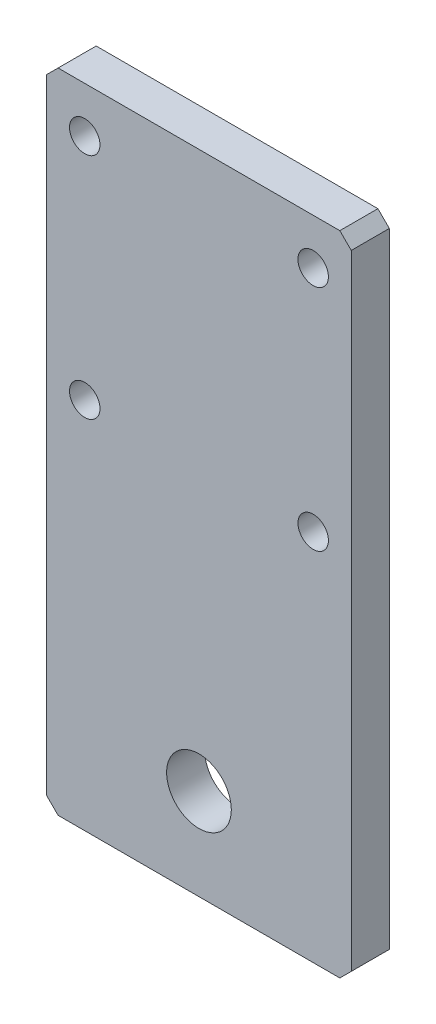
ISO-10303-21;
HEADER;
FILE_DESCRIPTION(('STEP AP214'),'2;1');
FILE_NAME('part.step','',(''),(''),'','','');
FILE_SCHEMA(('AUTOMOTIVE_DESIGN { 1 0 10303 214 1 1 1 1 }'));
ENDSEC;
DATA;
#1=APPLICATION_CONTEXT('core data for automotive mechanical design processes');
#2=APPLICATION_PROTOCOL_DEFINITION('international standard','automotive_design',2000,#1);
#3=PRODUCT_CONTEXT('',#1,'mechanical');
#4=PRODUCT('Part','Part','',(#3));
#5=PRODUCT_RELATED_PRODUCT_CATEGORY('part','',(#4));
#6=PRODUCT_DEFINITION_FORMATION('','',#4);
#7=PRODUCT_DEFINITION_CONTEXT('part definition',#1,'design');
#8=PRODUCT_DEFINITION('design','',#6,#7);
#9=PRODUCT_DEFINITION_SHAPE('','',#8);
#10=(LENGTH_UNIT() NAMED_UNIT(*) SI_UNIT(.MILLI.,.METRE.));
#11=(NAMED_UNIT(*) PLANE_ANGLE_UNIT() SI_UNIT($,.RADIAN.));
#12=(NAMED_UNIT(*) SI_UNIT($,.STERADIAN.) SOLID_ANGLE_UNIT());
#13=UNCERTAINTY_MEASURE_WITH_UNIT(LENGTH_MEASURE(1.E-05),#10,'distance_accuracy_value','');
#14=(GEOMETRIC_REPRESENTATION_CONTEXT(3) GLOBAL_UNCERTAINTY_ASSIGNED_CONTEXT((#13)) GLOBAL_UNIT_ASSIGNED_CONTEXT((#10,
#11,#12)) REPRESENTATION_CONTEXT('',''));
#15=CARTESIAN_POINT('',(0.,0.,0.));
#16=DIRECTION('',(0.,0.,1.));
#17=DIRECTION('',(1.,0.,0.));
#18=AXIS2_PLACEMENT_3D('',#15,#16,#17);
#19=CARTESIAN_POINT('',(80.,3.,10.));
#20=DIRECTION('',(-1.,0.,0.));
#21=DIRECTION('',(0.,0.,1.));
#22=AXIS2_PLACEMENT_3D('',#19,#20,#21);
#23=PLANE('',#22);
#24=DIRECTION('',(0.,1.,0.));
#25=VECTOR('',#24,1.);
#26=CARTESIAN_POINT('',(80.,3.,0.));
#27=LINE('',#26,#25);
#28=CARTESIAN_POINT('',(80.,3.,0.));
#29=VERTEX_POINT('',#28);
#30=CARTESIAN_POINT('',(80.,167.,0.));
#31=VERTEX_POINT('',#30);
#32=EDGE_CURVE('E85',#29,#31,#27,.T.);
#33=ORIENTED_EDGE('',*,*,#32,.T.);
#34=DIRECTION('',(0.,0.,-1.));
#35=VECTOR('',#34,1.);
#36=CARTESIAN_POINT('',(80.,167.,10.));
#37=LINE('',#36,#35);
#38=CARTESIAN_POINT('',(80.,167.,10.));
#39=VERTEX_POINT('',#38);
#40=EDGE_CURVE('E11',#39,#31,#37,.T.);
#41=ORIENTED_EDGE('',*,*,#40,.F.);
#42=DIRECTION('',(0.,1.,0.));
#43=VECTOR('',#42,1.);
#44=CARTESIAN_POINT('',(80.,3.,10.));
#45=LINE('',#44,#43);
#46=CARTESIAN_POINT('',(80.,3.,10.));
#47=VERTEX_POINT('',#46);
#48=EDGE_CURVE('E117',#47,#39,#45,.T.);
#49=ORIENTED_EDGE('',*,*,#48,.F.);
#50=DIRECTION('',(0.,0.,-1.));
#51=VECTOR('',#50,1.);
#52=CARTESIAN_POINT('',(80.,3.,10.));
#53=LINE('',#52,#51);
#54=EDGE_CURVE('E98',#47,#29,#53,.T.);
#55=ORIENTED_EDGE('',*,*,#54,.T.);
#56=EDGE_LOOP('',(#33,#41,#49,#55));
#57=FACE_BOUND('',#56,.T.);
#58=ADVANCED_FACE('F17',(#57),#23,.F.);
#59=CARTESIAN_POINT('',(80.,167.,10.));
#60=DIRECTION('',(-0.707106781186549,-0.707106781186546,0.));
#61=DIRECTION('',(0.707106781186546,-0.707106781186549,0.));
#62=AXIS2_PLACEMENT_3D('',#59,#60,#61);
#63=PLANE('',#62);
#64=DIRECTION('',(-0.707106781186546,0.707106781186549,0.));
#65=VECTOR('',#64,1.);
#66=CARTESIAN_POINT('',(80.,167.,0.));
#67=LINE('',#66,#65);
#68=CARTESIAN_POINT('',(77.,170.,0.));
#69=VERTEX_POINT('',#68);
#70=EDGE_CURVE('E81',#31,#69,#67,.T.);
#71=ORIENTED_EDGE('',*,*,#70,.T.);
#72=DIRECTION('',(0.,0.,-1.));
#73=VECTOR('',#72,1.);
#74=CARTESIAN_POINT('',(77.,170.,10.));
#75=LINE('',#74,#73);
#76=CARTESIAN_POINT('',(77.,170.,10.));
#77=VERTEX_POINT('',#76);
#78=EDGE_CURVE('E24',#77,#69,#75,.T.);
#79=ORIENTED_EDGE('',*,*,#78,.F.);
#80=DIRECTION('',(-0.707106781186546,0.707106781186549,0.));
#81=VECTOR('',#80,1.);
#82=CARTESIAN_POINT('',(80.,167.,10.));
#83=LINE('',#82,#81);
#84=EDGE_CURVE('E94',#39,#77,#83,.T.);
#85=ORIENTED_EDGE('',*,*,#84,.F.);
#86=ORIENTED_EDGE('',*,*,#40,.T.);
#87=EDGE_LOOP('',(#71,#79,#85,#86));
#88=FACE_BOUND('',#87,.T.);
#89=ADVANCED_FACE('F93',(#88),#63,.F.);
#90=CARTESIAN_POINT('',(3.,170.,10.));
#91=DIRECTION('',(0.,-1.,0.));
#92=DIRECTION('',(1.,0.,0.));
#93=AXIS2_PLACEMENT_3D('',#90,#91,#92);
#94=PLANE('',#93);
#95=DIRECTION('',(-1.,0.,0.));
#96=VECTOR('',#95,1.);
#97=CARTESIAN_POINT('',(3.,170.,0.));
#98=LINE('',#97,#96);
#99=CARTESIAN_POINT('',(3.,170.,0.));
#100=VERTEX_POINT('',#99);
#101=EDGE_CURVE('E87',#69,#100,#98,.T.);
#102=ORIENTED_EDGE('',*,*,#101,.T.);
#103=DIRECTION('',(0.,0.,-1.));
#104=VECTOR('',#103,1.);
#105=CARTESIAN_POINT('',(3.,170.,10.));
#106=LINE('',#105,#104);
#107=CARTESIAN_POINT('',(3.,170.,10.));
#108=VERTEX_POINT('',#107);
#109=EDGE_CURVE('E143',#108,#100,#106,.T.);
#110=ORIENTED_EDGE('',*,*,#109,.F.);
#111=DIRECTION('',(-1.,0.,0.));
#112=VECTOR('',#111,1.);
#113=CARTESIAN_POINT('',(3.,170.,10.));
#114=LINE('',#113,#112);
#115=EDGE_CURVE('E120',#77,#108,#114,.T.);
#116=ORIENTED_EDGE('',*,*,#115,.F.);
#117=ORIENTED_EDGE('',*,*,#78,.T.);
#118=EDGE_LOOP('',(#102,#110,#116,#117));
#119=FACE_BOUND('',#118,.T.);
#120=ADVANCED_FACE('F147',(#119),#94,.F.);
#121=CARTESIAN_POINT('',(0.,167.,10.));
#122=DIRECTION('',(0.707106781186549,-0.707106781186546,0.));
#123=DIRECTION('',(0.707106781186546,0.707106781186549,0.));
#124=AXIS2_PLACEMENT_3D('',#121,#122,#123);
#125=PLANE('',#124);
#126=DIRECTION('',(-0.707106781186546,-0.707106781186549,0.));
#127=VECTOR('',#126,1.);
#128=CARTESIAN_POINT('',(0.,167.,0.));
#129=LINE('',#128,#127);
#130=CARTESIAN_POINT('',(0.,167.,0.));
#131=VERTEX_POINT('',#130);
#132=EDGE_CURVE('E107',#100,#131,#129,.T.);
#133=ORIENTED_EDGE('',*,*,#132,.T.);
#134=DIRECTION('',(0.,0.,-1.));
#135=VECTOR('',#134,1.);
#136=CARTESIAN_POINT('',(0.,167.,10.));
#137=LINE('',#136,#135);
#138=CARTESIAN_POINT('',(0.,167.,10.));
#139=VERTEX_POINT('',#138);
#140=EDGE_CURVE('E140',#139,#131,#137,.T.);
#141=ORIENTED_EDGE('',*,*,#140,.F.);
#142=DIRECTION('',(-0.707106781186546,-0.707106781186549,0.));
#143=VECTOR('',#142,1.);
#144=CARTESIAN_POINT('',(0.,167.,10.));
#145=LINE('',#144,#143);
#146=EDGE_CURVE('E122',#108,#139,#145,.T.);
#147=ORIENTED_EDGE('',*,*,#146,.F.);
#148=ORIENTED_EDGE('',*,*,#109,.T.);
#149=EDGE_LOOP('',(#133,#141,#147,#148));
#150=FACE_BOUND('',#149,.T.);
#151=ADVANCED_FACE('F155',(#150),#125,.F.);
#152=CARTESIAN_POINT('',(0.,3.,10.));
#153=DIRECTION('',(1.,0.,0.));
#154=DIRECTION('',(0.,0.,-1.));
#155=AXIS2_PLACEMENT_3D('',#152,#153,#154);
#156=PLANE('',#155);
#157=DIRECTION('',(0.,-1.,0.));
#158=VECTOR('',#157,1.);
#159=CARTESIAN_POINT('',(0.,3.,0.));
#160=LINE('',#159,#158);
#161=CARTESIAN_POINT('',(0.,3.,0.));
#162=VERTEX_POINT('',#161);
#163=EDGE_CURVE('E109',#131,#162,#160,.T.);
#164=ORIENTED_EDGE('',*,*,#163,.T.);
#165=DIRECTION('',(0.,0.,-1.));
#166=VECTOR('',#165,1.);
#167=CARTESIAN_POINT('',(0.,3.,10.));
#168=LINE('',#167,#166);
#169=CARTESIAN_POINT('',(0.,3.,10.));
#170=VERTEX_POINT('',#169);
#171=EDGE_CURVE('E137',#170,#162,#168,.T.);
#172=ORIENTED_EDGE('',*,*,#171,.F.);
#173=DIRECTION('',(0.,-1.,0.));
#174=VECTOR('',#173,1.);
#175=CARTESIAN_POINT('',(0.,3.,10.));
#176=LINE('',#175,#174);
#177=EDGE_CURVE('E124',#139,#170,#176,.T.);
#178=ORIENTED_EDGE('',*,*,#177,.F.);
#179=ORIENTED_EDGE('',*,*,#140,.T.);
#180=EDGE_LOOP('',(#164,#172,#178,#179));
#181=FACE_BOUND('',#180,.T.);
#182=ADVANCED_FACE('F158',(#181),#156,.F.);
#183=CARTESIAN_POINT('',(3.,0.,10.));
#184=DIRECTION('',(0.707106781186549,0.707106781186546,0.));
#185=DIRECTION('',(-0.707106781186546,0.707106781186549,0.));
#186=AXIS2_PLACEMENT_3D('',#183,#184,#185);
#187=PLANE('',#186);
#188=DIRECTION('',(0.707106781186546,-0.707106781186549,0.));
#189=VECTOR('',#188,1.);
#190=CARTESIAN_POINT('',(3.,0.,0.));
#191=LINE('',#190,#189);
#192=CARTESIAN_POINT('',(3.,0.,0.));
#193=VERTEX_POINT('',#192);
#194=EDGE_CURVE('E111',#162,#193,#191,.T.);
#195=ORIENTED_EDGE('',*,*,#194,.T.);
#196=DIRECTION('',(0.,0.,-1.));
#197=VECTOR('',#196,1.);
#198=CARTESIAN_POINT('',(3.,0.,10.));
#199=LINE('',#198,#197);
#200=CARTESIAN_POINT('',(3.,0.,10.));
#201=VERTEX_POINT('',#200);
#202=EDGE_CURVE('E134',#201,#193,#199,.T.);
#203=ORIENTED_EDGE('',*,*,#202,.F.);
#204=DIRECTION('',(0.707106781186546,-0.707106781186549,0.));
#205=VECTOR('',#204,1.);
#206=CARTESIAN_POINT('',(3.,0.,10.));
#207=LINE('',#206,#205);
#208=EDGE_CURVE('E126',#170,#201,#207,.T.);
#209=ORIENTED_EDGE('',*,*,#208,.F.);
#210=ORIENTED_EDGE('',*,*,#171,.T.);
#211=EDGE_LOOP('',(#195,#203,#209,#210));
#212=FACE_BOUND('',#211,.T.);
#213=ADVANCED_FACE('F163',(#212),#187,.F.);
#214=CARTESIAN_POINT('',(3.,0.,10.));
#215=DIRECTION('',(0.,1.,0.));
#216=DIRECTION('',(0.,0.,1.));
#217=AXIS2_PLACEMENT_3D('',#214,#215,#216);
#218=PLANE('',#217);
#219=DIRECTION('',(1.,0.,0.));
#220=VECTOR('',#219,1.);
#221=CARTESIAN_POINT('',(3.,0.,0.));
#222=LINE('',#221,#220);
#223=CARTESIAN_POINT('',(77.,0.,0.));
#224=VERTEX_POINT('',#223);
#225=EDGE_CURVE('E113',#193,#224,#222,.T.);
#226=ORIENTED_EDGE('',*,*,#225,.T.);
#227=DIRECTION('',(0.,0.,-1.));
#228=VECTOR('',#227,1.);
#229=CARTESIAN_POINT('',(77.,0.,10.));
#230=LINE('',#229,#228);
#231=CARTESIAN_POINT('',(77.,0.,10.));
#232=VERTEX_POINT('',#231);
#233=EDGE_CURVE('E131',#232,#224,#230,.T.);
#234=ORIENTED_EDGE('',*,*,#233,.F.);
#235=DIRECTION('',(1.,0.,0.));
#236=VECTOR('',#235,1.);
#237=CARTESIAN_POINT('',(3.,0.,10.));
#238=LINE('',#237,#236);
#239=EDGE_CURVE('E36',#201,#232,#238,.T.);
#240=ORIENTED_EDGE('',*,*,#239,.F.);
#241=ORIENTED_EDGE('',*,*,#202,.T.);
#242=EDGE_LOOP('',(#226,#234,#240,#241));
#243=FACE_BOUND('',#242,.T.);
#244=ADVANCED_FACE('F166',(#243),#218,.F.);
#245=CARTESIAN_POINT('',(77.,0.,10.));
#246=DIRECTION('',(-0.707106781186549,0.707106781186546,0.));
#247=DIRECTION('',(-0.707106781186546,-0.707106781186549,0.));
#248=AXIS2_PLACEMENT_3D('',#245,#246,#247);
#249=PLANE('',#248);
#250=DIRECTION('',(0.707106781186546,0.707106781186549,0.));
#251=VECTOR('',#250,1.);
#252=CARTESIAN_POINT('',(77.,0.,0.));
#253=LINE('',#252,#251);
#254=EDGE_CURVE('E115',#224,#29,#253,.T.);
#255=ORIENTED_EDGE('',*,*,#254,.T.);
#256=ORIENTED_EDGE('',*,*,#54,.F.);
#257=DIRECTION('',(0.707106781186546,0.707106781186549,0.));
#258=VECTOR('',#257,1.);
#259=CARTESIAN_POINT('',(77.,0.,10.));
#260=LINE('',#259,#258);
#261=EDGE_CURVE('E31',#232,#47,#260,.T.);
#262=ORIENTED_EDGE('',*,*,#261,.F.);
#263=ORIENTED_EDGE('',*,*,#233,.T.);
#264=EDGE_LOOP('',(#255,#256,#262,#263));
#265=FACE_BOUND('',#264,.T.);
#266=ADVANCED_FACE('F168',(#265),#249,.F.);
#267=CARTESIAN_POINT('',(80.,0.,10.));
#268=DIRECTION('',(0.,0.,-1.));
#269=DIRECTION('',(-1.,0.,0.));
#270=AXIS2_PLACEMENT_3D('',#267,#268,#269);
#271=PLANE('',#270);
#272=CARTESIAN_POINT('',(10.,158.,10.));
#273=DIRECTION('',(0.,0.,1.));
#274=DIRECTION('',(1.,0.,0.));
#275=AXIS2_PLACEMENT_3D('',#272,#273,#274);
#276=CIRCLE('',#275,4.);
#277=CARTESIAN_POINT('',(14.,158.,10.));
#278=VERTEX_POINT('',#277);
#279=EDGE_CURVE('E257',#278,#278,#276,.T.);
#280=ORIENTED_EDGE('',*,*,#279,.F.);
#281=EDGE_LOOP('',(#280));
#282=FACE_BOUND('',#281,.T.);
#283=CARTESIAN_POINT('',(70.,158.,10.));
#284=DIRECTION('',(0.,0.,1.));
#285=DIRECTION('',(1.,0.,0.));
#286=AXIS2_PLACEMENT_3D('',#283,#284,#285);
#287=CIRCLE('',#286,4.);
#288=CARTESIAN_POINT('',(74.,158.,10.));
#289=VERTEX_POINT('',#288);
#290=EDGE_CURVE('E259',#289,#289,#287,.T.);
#291=ORIENTED_EDGE('',*,*,#290,.F.);
#292=EDGE_LOOP('',(#291));
#293=FACE_BOUND('',#292,.T.);
#294=CARTESIAN_POINT('',(10.,98.,10.));
#295=DIRECTION('',(0.,0.,1.));
#296=DIRECTION('',(1.,0.,0.));
#297=AXIS2_PLACEMENT_3D('',#294,#295,#296);
#298=CIRCLE('',#297,4.);
#299=CARTESIAN_POINT('',(14.,98.,10.));
#300=VERTEX_POINT('',#299);
#301=EDGE_CURVE('E267',#300,#300,#298,.T.);
#302=ORIENTED_EDGE('',*,*,#301,.F.);
#303=EDGE_LOOP('',(#302));
#304=FACE_BOUND('',#303,.T.);
#305=CARTESIAN_POINT('',(70.,98.,10.));
#306=DIRECTION('',(0.,0.,1.));
#307=DIRECTION('',(1.,0.,0.));
#308=AXIS2_PLACEMENT_3D('',#305,#306,#307);
#309=CIRCLE('',#308,4.);
#310=CARTESIAN_POINT('',(74.,98.,10.));
#311=VERTEX_POINT('',#310);
#312=EDGE_CURVE('E273',#311,#311,#309,.T.);
#313=ORIENTED_EDGE('',*,*,#312,.F.);
#314=EDGE_LOOP('',(#313));
#315=FACE_BOUND('',#314,.T.);
#316=CARTESIAN_POINT('',(40.,24.,10.));
#317=DIRECTION('',(0.,0.,1.));
#318=DIRECTION('',(1.,0.,0.));
#319=AXIS2_PLACEMENT_3D('',#316,#317,#318);
#320=CIRCLE('',#319,8.5);
#321=CARTESIAN_POINT('',(48.5,24.,10.));
#322=VERTEX_POINT('',#321);
#323=EDGE_CURVE('E102',#322,#322,#320,.T.);
#324=ORIENTED_EDGE('',*,*,#323,.F.);
#325=EDGE_LOOP('',(#324));
#326=FACE_BOUND('',#325,.T.);
#327=ORIENTED_EDGE('',*,*,#48,.T.);
#328=ORIENTED_EDGE('',*,*,#84,.T.);
#329=ORIENTED_EDGE('',*,*,#115,.T.);
#330=ORIENTED_EDGE('',*,*,#146,.T.);
#331=ORIENTED_EDGE('',*,*,#177,.T.);
#332=ORIENTED_EDGE('',*,*,#208,.T.);
#333=ORIENTED_EDGE('',*,*,#239,.T.);
#334=ORIENTED_EDGE('',*,*,#261,.T.);
#335=EDGE_LOOP('',(#327,#328,#329,#330,#331,#332,#333,#334));
#336=FACE_BOUND('',#335,.T.);
#337=ADVANCED_FACE('F150',(#282,#293,#304,#315,#326,#336),#271,.F.);
#338=CARTESIAN_POINT('',(80.,0.,0.));
#339=DIRECTION('',(0.,0.,-1.));
#340=DIRECTION('',(-1.,0.,0.));
#341=AXIS2_PLACEMENT_3D('',#338,#339,#340);
#342=PLANE('',#341);
#343=CARTESIAN_POINT('',(10.,158.,0.));
#344=DIRECTION('',(0.,0.,1.));
#345=DIRECTION('',(1.,0.,0.));
#346=AXIS2_PLACEMENT_3D('',#343,#344,#345);
#347=CIRCLE('',#346,4.);
#348=CARTESIAN_POINT('',(14.,158.,0.));
#349=VERTEX_POINT('',#348);
#350=EDGE_CURVE('E254',#349,#349,#347,.T.);
#351=ORIENTED_EDGE('',*,*,#350,.T.);
#352=EDGE_LOOP('',(#351));
#353=FACE_BOUND('',#352,.T.);
#354=CARTESIAN_POINT('',(70.,158.,0.));
#355=DIRECTION('',(0.,0.,1.));
#356=DIRECTION('',(1.,0.,0.));
#357=AXIS2_PLACEMENT_3D('',#354,#355,#356);
#358=CIRCLE('',#357,4.);
#359=CARTESIAN_POINT('',(74.,158.,0.));
#360=VERTEX_POINT('',#359);
#361=EDGE_CURVE('E264',#360,#360,#358,.T.);
#362=ORIENTED_EDGE('',*,*,#361,.T.);
#363=EDGE_LOOP('',(#362));
#364=FACE_BOUND('',#363,.T.);
#365=CARTESIAN_POINT('',(10.,98.,0.));
#366=DIRECTION('',(0.,0.,1.));
#367=DIRECTION('',(1.,0.,0.));
#368=AXIS2_PLACEMENT_3D('',#365,#366,#367);
#369=CIRCLE('',#368,4.);
#370=CARTESIAN_POINT('',(14.,98.,0.));
#371=VERTEX_POINT('',#370);
#372=EDGE_CURVE('E270',#371,#371,#369,.T.);
#373=ORIENTED_EDGE('',*,*,#372,.T.);
#374=EDGE_LOOP('',(#373));
#375=FACE_BOUND('',#374,.T.);
#376=CARTESIAN_POINT('',(70.,98.,0.));
#377=DIRECTION('',(0.,0.,1.));
#378=DIRECTION('',(1.,0.,0.));
#379=AXIS2_PLACEMENT_3D('',#376,#377,#378);
#380=CIRCLE('',#379,4.);
#381=CARTESIAN_POINT('',(74.,98.,0.));
#382=VERTEX_POINT('',#381);
#383=EDGE_CURVE('E276',#382,#382,#380,.T.);
#384=ORIENTED_EDGE('',*,*,#383,.T.);
#385=EDGE_LOOP('',(#384));
#386=FACE_BOUND('',#385,.T.);
#387=CARTESIAN_POINT('',(40.,24.,0.));
#388=DIRECTION('',(0.,0.,1.));
#389=DIRECTION('',(1.,0.,0.));
#390=AXIS2_PLACEMENT_3D('',#387,#388,#389);
#391=CIRCLE('',#390,8.5);
#392=CARTESIAN_POINT('',(48.5,24.,0.));
#393=VERTEX_POINT('',#392);
#394=EDGE_CURVE('E99',#393,#393,#391,.T.);
#395=ORIENTED_EDGE('',*,*,#394,.T.);
#396=EDGE_LOOP('',(#395));
#397=FACE_BOUND('',#396,.T.);
#398=ORIENTED_EDGE('',*,*,#32,.F.);
#399=ORIENTED_EDGE('',*,*,#254,.F.);
#400=ORIENTED_EDGE('',*,*,#225,.F.);
#401=ORIENTED_EDGE('',*,*,#194,.F.);
#402=ORIENTED_EDGE('',*,*,#163,.F.);
#403=ORIENTED_EDGE('',*,*,#132,.F.);
#404=ORIENTED_EDGE('',*,*,#101,.F.);
#405=ORIENTED_EDGE('',*,*,#70,.F.);
#406=EDGE_LOOP('',(#398,#399,#400,#401,#402,#403,#404,#405));
#407=FACE_BOUND('',#406,.T.);
#408=ADVANCED_FACE('F82',(#353,#364,#375,#386,#397,#407),#342,.T.);
#409=CARTESIAN_POINT('',(40.,24.,0.));
#410=DIRECTION('',(0.,0.,1.));
#411=DIRECTION('',(1.,0.,0.));
#412=AXIS2_PLACEMENT_3D('',#409,#410,#411);
#413=CYLINDRICAL_SURFACE('',#412,8.5);
#414=ORIENTED_EDGE('',*,*,#394,.F.);
#415=EDGE_LOOP('',(#414));
#416=FACE_BOUND('',#415,.T.);
#417=ORIENTED_EDGE('',*,*,#323,.T.);
#418=EDGE_LOOP('',(#417));
#419=FACE_BOUND('',#418,.T.);
#420=ADVANCED_FACE('F206',(#416,#419),#413,.F.);
#421=CARTESIAN_POINT('',(70.,98.,0.));
#422=DIRECTION('',(0.,0.,1.));
#423=DIRECTION('',(1.,0.,0.));
#424=AXIS2_PLACEMENT_3D('',#421,#422,#423);
#425=CYLINDRICAL_SURFACE('',#424,4.);
#426=ORIENTED_EDGE('',*,*,#383,.F.);
#427=EDGE_LOOP('',(#426));
#428=FACE_BOUND('',#427,.T.);
#429=ORIENTED_EDGE('',*,*,#312,.T.);
#430=EDGE_LOOP('',(#429));
#431=FACE_BOUND('',#430,.T.);
#432=ADVANCED_FACE('F214',(#428,#431),#425,.F.);
#433=CARTESIAN_POINT('',(10.,98.,0.));
#434=DIRECTION('',(0.,0.,1.));
#435=DIRECTION('',(1.,0.,0.));
#436=AXIS2_PLACEMENT_3D('',#433,#434,#435);
#437=CYLINDRICAL_SURFACE('',#436,4.);
#438=ORIENTED_EDGE('',*,*,#372,.F.);
#439=EDGE_LOOP('',(#438));
#440=FACE_BOUND('',#439,.T.);
#441=ORIENTED_EDGE('',*,*,#301,.T.);
#442=EDGE_LOOP('',(#441));
#443=FACE_BOUND('',#442,.T.);
#444=ADVANCED_FACE('F222',(#440,#443),#437,.F.);
#445=CARTESIAN_POINT('',(70.,158.,0.));
#446=DIRECTION('',(0.,0.,1.));
#447=DIRECTION('',(1.,0.,0.));
#448=AXIS2_PLACEMENT_3D('',#445,#446,#447);
#449=CYLINDRICAL_SURFACE('',#448,4.);
#450=ORIENTED_EDGE('',*,*,#361,.F.);
#451=EDGE_LOOP('',(#450));
#452=FACE_BOUND('',#451,.T.);
#453=ORIENTED_EDGE('',*,*,#290,.T.);
#454=EDGE_LOOP('',(#453));
#455=FACE_BOUND('',#454,.T.);
#456=ADVANCED_FACE('F230',(#452,#455),#449,.F.);
#457=CARTESIAN_POINT('',(10.,158.,0.));
#458=DIRECTION('',(0.,0.,1.));
#459=DIRECTION('',(1.,0.,0.));
#460=AXIS2_PLACEMENT_3D('',#457,#458,#459);
#461=CYLINDRICAL_SURFACE('',#460,4.);
#462=ORIENTED_EDGE('',*,*,#350,.F.);
#463=EDGE_LOOP('',(#462));
#464=FACE_BOUND('',#463,.T.);
#465=ORIENTED_EDGE('',*,*,#279,.T.);
#466=EDGE_LOOP('',(#465));
#467=FACE_BOUND('',#466,.T.);
#468=ADVANCED_FACE('F238',(#464,#467),#461,.F.);
#469=CLOSED_SHELL('',(#58,#89,#120,#151,#182,#213,#244,#266,#337,#408,#420,#432,#444,#456,#468));
#470=MANIFOLD_SOLID_BREP('B1',#469);
#471=ADVANCED_BREP_SHAPE_REPRESENTATION('',(#18,#470),#14);
#472=SHAPE_DEFINITION_REPRESENTATION(#9,#471);
ENDSEC;
END-ISO-10303-21;
